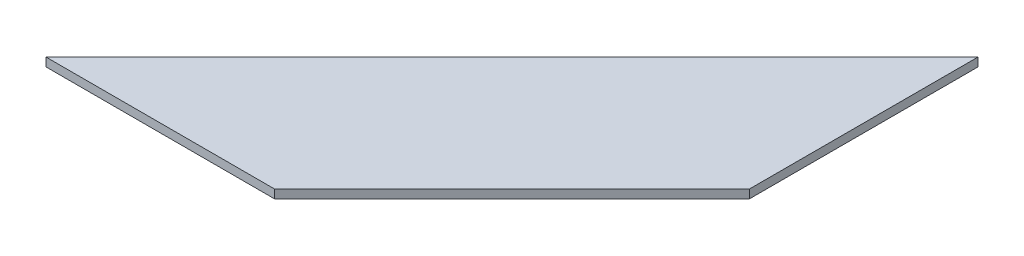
ISO-10303-21;
HEADER;
FILE_DESCRIPTION(('STEP AP214'),'2;1');
FILE_NAME('part.step','',(''),(''),'','','');
FILE_SCHEMA(('AUTOMOTIVE_DESIGN { 1 0 10303 214 1 1 1 1 }'));
ENDSEC;
DATA;
#1=APPLICATION_CONTEXT('core data for automotive mechanical design processes');
#2=APPLICATION_PROTOCOL_DEFINITION('international standard','automotive_design',2000,#1);
#3=PRODUCT_CONTEXT('',#1,'mechanical');
#4=PRODUCT('Part','Part','',(#3));
#5=PRODUCT_RELATED_PRODUCT_CATEGORY('part','',(#4));
#6=PRODUCT_DEFINITION_FORMATION('','',#4);
#7=PRODUCT_DEFINITION_CONTEXT('part definition',#1,'design');
#8=PRODUCT_DEFINITION('design','',#6,#7);
#9=PRODUCT_DEFINITION_SHAPE('','',#8);
#10=(LENGTH_UNIT() NAMED_UNIT(*) SI_UNIT(.MILLI.,.METRE.));
#11=(NAMED_UNIT(*) PLANE_ANGLE_UNIT() SI_UNIT($,.RADIAN.));
#12=(NAMED_UNIT(*) SI_UNIT($,.STERADIAN.) SOLID_ANGLE_UNIT());
#13=UNCERTAINTY_MEASURE_WITH_UNIT(LENGTH_MEASURE(1.E-05),#10,'distance_accuracy_value','');
#14=(GEOMETRIC_REPRESENTATION_CONTEXT(3) GLOBAL_UNCERTAINTY_ASSIGNED_CONTEXT((#13)) GLOBAL_UNIT_ASSIGNED_CONTEXT((#10,
#11,#12)) REPRESENTATION_CONTEXT('',''));
#15=CARTESIAN_POINT('',(0.,0.,0.));
#16=DIRECTION('',(0.,0.,1.));
#17=DIRECTION('',(1.,0.,0.));
#18=AXIS2_PLACEMENT_3D('',#15,#16,#17);
#19=CARTESIAN_POINT('',(0.,-1.5,-163.));
#20=DIRECTION('',(-0.707106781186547,0.,-0.707106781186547));
#21=DIRECTION('',(-0.707106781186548,0.,0.707106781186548));
#22=AXIS2_PLACEMENT_3D('',#19,#20,#21);
#23=PLANE('',#22);
#24=DIRECTION('',(-0.707106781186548,0.,0.707106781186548));
#25=VECTOR('',#24,1.);
#26=CARTESIAN_POINT('',(0.,1.5,-163.));
#27=LINE('',#26,#25);
#28=CARTESIAN_POINT('',(0.,1.5,-163.));
#29=VERTEX_POINT('',#28);
#30=CARTESIAN_POINT('',(-163.,1.5,0.));
#31=VERTEX_POINT('',#30);
#32=EDGE_CURVE('E99',#29,#31,#27,.T.);
#33=ORIENTED_EDGE('',*,*,#32,.F.);
#34=DIRECTION('',(0.,1.,0.));
#35=VECTOR('',#34,1.);
#36=CARTESIAN_POINT('',(0.,-1.5,-163.));
#37=LINE('',#36,#35);
#38=CARTESIAN_POINT('',(0.,-1.5,-163.));
#39=VERTEX_POINT('',#38);
#40=EDGE_CURVE('E11',#39,#29,#37,.T.);
#41=ORIENTED_EDGE('',*,*,#40,.F.);
#42=DIRECTION('',(-0.707106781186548,0.,0.707106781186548));
#43=VECTOR('',#42,1.);
#44=CARTESIAN_POINT('',(0.,-1.5,-163.));
#45=LINE('',#44,#43);
#46=CARTESIAN_POINT('',(-163.,-1.5,0.));
#47=VERTEX_POINT('',#46);
#48=EDGE_CURVE('E93',#39,#47,#45,.T.);
#49=ORIENTED_EDGE('',*,*,#48,.T.);
#50=DIRECTION('',(0.,1.,0.));
#51=VECTOR('',#50,1.);
#52=CARTESIAN_POINT('',(-163.,-1.5,0.));
#53=LINE('',#52,#51);
#54=EDGE_CURVE('E38',#47,#31,#53,.T.);
#55=ORIENTED_EDGE('',*,*,#54,.T.);
#56=EDGE_LOOP('',(#33,#41,#49,#55));
#57=FACE_BOUND('',#56,.T.);
#58=ADVANCED_FACE('F35',(#57),#23,.T.);
#59=CARTESIAN_POINT('',(0.,-1.5,-83.));
#60=DIRECTION('',(1.,0.,0.));
#61=DIRECTION('',(0.,0.,-1.));
#62=AXIS2_PLACEMENT_3D('',#59,#60,#61);
#63=PLANE('',#62);
#64=DIRECTION('',(0.,0.,-1.));
#65=VECTOR('',#64,1.);
#66=CARTESIAN_POINT('',(0.,1.5,-83.));
#67=LINE('',#66,#65);
#68=CARTESIAN_POINT('',(0.,1.5,-83.));
#69=VERTEX_POINT('',#68);
#70=EDGE_CURVE('E95',#69,#29,#67,.T.);
#71=ORIENTED_EDGE('',*,*,#70,.F.);
#72=DIRECTION('',(0.,1.,0.));
#73=VECTOR('',#72,1.);
#74=CARTESIAN_POINT('',(0.,-1.5,-83.));
#75=LINE('',#74,#73);
#76=CARTESIAN_POINT('',(0.,-1.5,-83.));
#77=VERTEX_POINT('',#76);
#78=EDGE_CURVE('E44',#77,#69,#75,.T.);
#79=ORIENTED_EDGE('',*,*,#78,.F.);
#80=DIRECTION('',(0.,0.,-1.));
#81=VECTOR('',#80,1.);
#82=CARTESIAN_POINT('',(0.,-1.5,-83.));
#83=LINE('',#82,#81);
#84=EDGE_CURVE('E90',#77,#39,#83,.T.);
#85=ORIENTED_EDGE('',*,*,#84,.T.);
#86=ORIENTED_EDGE('',*,*,#40,.T.);
#87=EDGE_LOOP('',(#71,#79,#85,#86));
#88=FACE_BOUND('',#87,.T.);
#89=ADVANCED_FACE('F109',(#88),#63,.T.);
#90=CARTESIAN_POINT('',(-83.,-1.5,0.));
#91=DIRECTION('',(0.707106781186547,0.,0.707106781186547));
#92=DIRECTION('',(0.707106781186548,0.,-0.707106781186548));
#93=AXIS2_PLACEMENT_3D('',#90,#91,#92);
#94=PLANE('',#93);
#95=DIRECTION('',(0.707106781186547,0.,-0.707106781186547));
#96=VECTOR('',#95,1.);
#97=CARTESIAN_POINT('',(-83.,1.5,0.));
#98=LINE('',#97,#96);
#99=CARTESIAN_POINT('',(-83.,1.5,0.));
#100=VERTEX_POINT('',#99);
#101=EDGE_CURVE('E85',#100,#69,#98,.T.);
#102=ORIENTED_EDGE('',*,*,#101,.F.);
#103=DIRECTION('',(0.,1.,0.));
#104=VECTOR('',#103,1.);
#105=CARTESIAN_POINT('',(-83.,-1.5,0.));
#106=LINE('',#105,#104);
#107=CARTESIAN_POINT('',(-83.,-1.5,0.));
#108=VERTEX_POINT('',#107);
#109=EDGE_CURVE('E80',#108,#100,#106,.T.);
#110=ORIENTED_EDGE('',*,*,#109,.F.);
#111=DIRECTION('',(0.707106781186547,0.,-0.707106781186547));
#112=VECTOR('',#111,1.);
#113=CARTESIAN_POINT('',(-83.,-1.5,0.));
#114=LINE('',#113,#112);
#115=EDGE_CURVE('E83',#108,#77,#114,.T.);
#116=ORIENTED_EDGE('',*,*,#115,.T.);
#117=ORIENTED_EDGE('',*,*,#78,.T.);
#118=EDGE_LOOP('',(#102,#110,#116,#117));
#119=FACE_BOUND('',#118,.T.);
#120=ADVANCED_FACE('F82',(#119),#94,.T.);
#121=CARTESIAN_POINT('',(-163.,-1.5,0.));
#122=DIRECTION('',(0.,0.,1.));
#123=DIRECTION('',(1.,0.,0.));
#124=AXIS2_PLACEMENT_3D('',#121,#122,#123);
#125=PLANE('',#124);
#126=DIRECTION('',(1.,0.,0.));
#127=VECTOR('',#126,1.);
#128=CARTESIAN_POINT('',(-163.,1.5,0.));
#129=LINE('',#128,#127);
#130=EDGE_CURVE('E102',#31,#100,#129,.T.);
#131=ORIENTED_EDGE('',*,*,#130,.F.);
#132=ORIENTED_EDGE('',*,*,#54,.F.);
#133=DIRECTION('',(1.,0.,0.));
#134=VECTOR('',#133,1.);
#135=CARTESIAN_POINT('',(-163.,-1.5,0.));
#136=LINE('',#135,#134);
#137=EDGE_CURVE('E89',#47,#108,#136,.T.);
#138=ORIENTED_EDGE('',*,*,#137,.T.);
#139=ORIENTED_EDGE('',*,*,#109,.T.);
#140=EDGE_LOOP('',(#131,#132,#138,#139));
#141=FACE_BOUND('',#140,.T.);
#142=ADVANCED_FACE('F92',(#141),#125,.T.);
#143=CARTESIAN_POINT('',(0.,-1.5,0.));
#144=DIRECTION('',(0.,1.,0.));
#145=DIRECTION('',(0.,0.,1.));
#146=AXIS2_PLACEMENT_3D('',#143,#144,#145);
#147=PLANE('',#146);
#148=ORIENTED_EDGE('',*,*,#48,.F.);
#149=ORIENTED_EDGE('',*,*,#84,.F.);
#150=ORIENTED_EDGE('',*,*,#115,.F.);
#151=ORIENTED_EDGE('',*,*,#137,.F.);
#152=EDGE_LOOP('',(#148,#149,#150,#151));
#153=FACE_BOUND('',#152,.T.);
#154=ADVANCED_FACE('F88',(#153),#147,.F.);
#155=CARTESIAN_POINT('',(0.,1.5,0.));
#156=DIRECTION('',(0.,1.,0.));
#157=DIRECTION('',(0.,0.,1.));
#158=AXIS2_PLACEMENT_3D('',#155,#156,#157);
#159=PLANE('',#158);
#160=ORIENTED_EDGE('',*,*,#32,.T.);
#161=ORIENTED_EDGE('',*,*,#130,.T.);
#162=ORIENTED_EDGE('',*,*,#101,.T.);
#163=ORIENTED_EDGE('',*,*,#70,.T.);
#164=EDGE_LOOP('',(#160,#161,#162,#163));
#165=FACE_BOUND('',#164,.T.);
#166=ADVANCED_FACE('F108',(#165),#159,.T.);
#167=CLOSED_SHELL('',(#58,#89,#120,#142,#154,#166));
#168=MANIFOLD_SOLID_BREP('B2',#167);
#169=ADVANCED_BREP_SHAPE_REPRESENTATION('',(#18,#168),#14);
#170=SHAPE_DEFINITION_REPRESENTATION(#9,#169);
ENDSEC;
END-ISO-10303-21;
